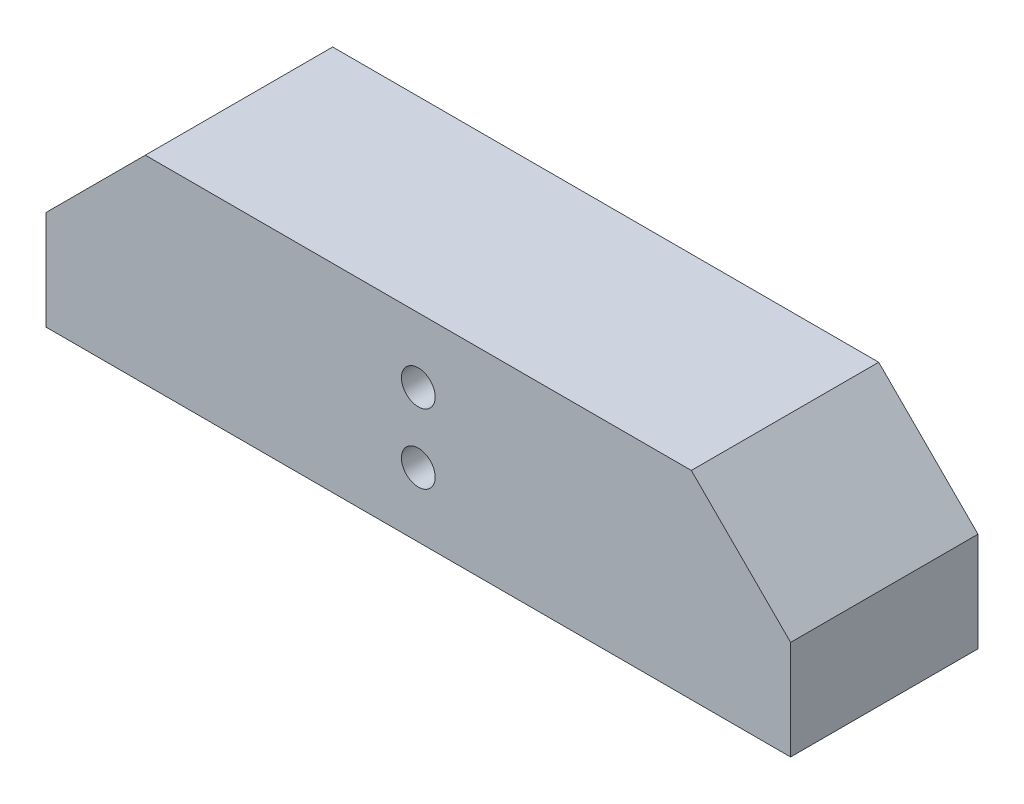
from build123d import *

# Parameters (mm, degrees)
BOSS_EXTRUDE1_DEPTH = 10
FILLET1_R           = 2
SKETCH2_R           = 1
CUT_EXTRUDE1_DEPTH  = 10
SKETCH4_W           = 150
SKETCH4_H           = 40
BOSS_EXTRUDE3_DEPTH = 27.75
CHAMFER1_SIZE       = 20
SKETCH5_R           = 3.4
CUT_EXTRUDE2_DEPTH  = 20


with BuildPart() as part:
    # Sketch1 → Boss-Extrude1 (new body)
    with BuildSketch(Plane.XY):
        with BuildLine():
            Line((-31.733500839, -20), (31.733500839, -20))
            ThreePointArc((31.733500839, -20), (45, 2), (58.266499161, -20))
            Line((58.266499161, -20), (75, -20))
            Line((75, -20), (75, 20))
            Line((75, 20), (-75, 20))
            Line((-75, 20), (-75, -20))
            Line((-75, -20), (-58.266499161, -20))
            ThreePointArc((-58.266499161, -20), (-45, 2), (-31.733500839, -20))
        make_face()
    extrude(amount=BOSS_EXTRUDE1_DEPTH)

    # Fillet1
    fillet1_edges = [part.edges().sort_by_distance(p)[0] for p in [
        (58.266499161, -20, 5),
        (31.733500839, -20, 5),
        (-31.733500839, -20, 5),
        (-58.266499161, -20, 5),
    ]]
    fillet(fillet1_edges, radius=FILLET1_R)

    # Sketch2 → Cut-Extrude1 (cut)
    with BuildSketch(Plane.XY.offset(10)):
        with Locations((-66.9, -17)):
            Circle(SKETCH2_R)
        with Locations((-23.1, -17)):
            Circle(SKETCH2_R)
        with Locations((23.1, -17)):
            Circle(SKETCH2_R)
        with Locations((66.9, -17)):
            Circle(SKETCH2_R)
    extrude(amount=-CUT_EXTRUDE1_DEPTH, mode=Mode.SUBTRACT)

    # Sketch4 → Boss-Extrude3 (add)
    with BuildSketch(Plane.XY.offset(10)):
        Rectangle(SKETCH4_W, SKETCH4_H)
    extrude(amount=BOSS_EXTRUDE3_DEPTH)

    # Chamfer1
    chamfer1_edges = [part.edges().sort_by_distance(p)[0] for p in [
        (-75, 20, 18.875),
        (75, 20, 18.875),
    ]]
    chamfer(chamfer1_edges, length=CHAMFER1_SIZE)

    # Sketch5 → Cut-Extrude2 (cut)
    with BuildSketch(Plane.XY.offset(37.75)):
        with Locations((0, 7)):
            Circle(SKETCH5_R)
        with Locations((0, -7)):
            Circle(SKETCH5_R)
    extrude(amount=-CUT_EXTRUDE2_DEPTH, mode=Mode.SUBTRACT)


solid = part.part
